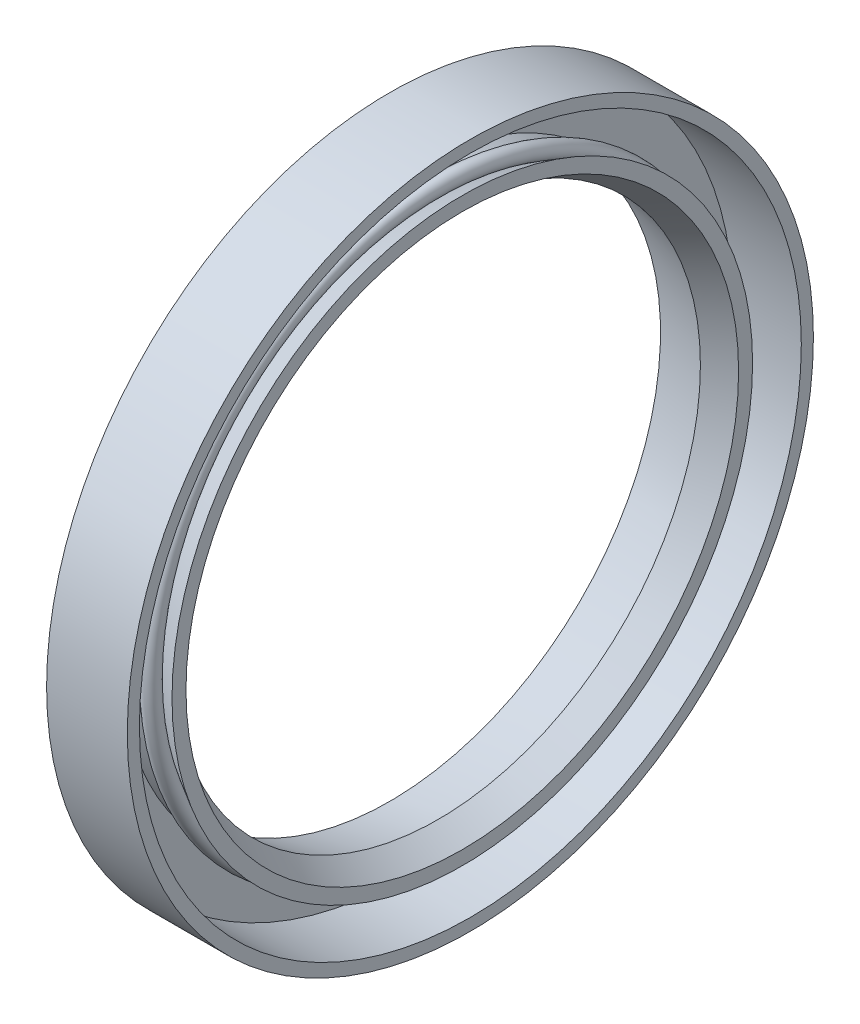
ISO-10303-21;
HEADER;
FILE_DESCRIPTION(('STEP AP214'),'2;1');
FILE_NAME('part.step','',(''),(''),'','','');
FILE_SCHEMA(('AUTOMOTIVE_DESIGN { 1 0 10303 214 1 1 1 1 }'));
ENDSEC;
DATA;
#1=APPLICATION_CONTEXT('core data for automotive mechanical design processes');
#2=APPLICATION_PROTOCOL_DEFINITION('international standard','automotive_design',2000,#1);
#3=PRODUCT_CONTEXT('',#1,'mechanical');
#4=PRODUCT('Part','Part','',(#3));
#5=PRODUCT_RELATED_PRODUCT_CATEGORY('part','',(#4));
#6=PRODUCT_DEFINITION_FORMATION('','',#4);
#7=PRODUCT_DEFINITION_CONTEXT('part definition',#1,'design');
#8=PRODUCT_DEFINITION('design','',#6,#7);
#9=PRODUCT_DEFINITION_SHAPE('','',#8);
#10=(LENGTH_UNIT() NAMED_UNIT(*) SI_UNIT(.MILLI.,.METRE.));
#11=(NAMED_UNIT(*) PLANE_ANGLE_UNIT() SI_UNIT($,.RADIAN.));
#12=(NAMED_UNIT(*) SI_UNIT($,.STERADIAN.) SOLID_ANGLE_UNIT());
#13=UNCERTAINTY_MEASURE_WITH_UNIT(LENGTH_MEASURE(1.E-05),#10,'distance_accuracy_value','');
#14=(GEOMETRIC_REPRESENTATION_CONTEXT(3) GLOBAL_UNCERTAINTY_ASSIGNED_CONTEXT((#13)) GLOBAL_UNIT_ASSIGNED_CONTEXT((#10,
#11,#12)) REPRESENTATION_CONTEXT('',''));
#15=CARTESIAN_POINT('',(0.,0.,0.));
#16=DIRECTION('',(0.,0.,1.));
#17=DIRECTION('',(1.,0.,0.));
#18=AXIS2_PLACEMENT_3D('',#15,#16,#17);
#19=CARTESIAN_POINT('',(5.53801867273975,0.,0.));
#20=DIRECTION('',(-1.,0.,0.));
#21=DIRECTION('',(0.,0.,1.));
#22=AXIS2_PLACEMENT_3D('',#19,#20,#21);
#23=TOROIDAL_SURFACE('',#22,35.1200263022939,1.);
#24=CARTESIAN_POINT('',(5.53801867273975,0.,36.1200263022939));
#25=VERTEX_POINT('',#24);
#26=VERTEX_LOOP('',#25);
#27=FACE_BOUND('',#26,.T.);
#28=ADVANCED_FACE('F436',(#27),#23,.T.);
#29=CLOSED_SHELL('',(#28));
#30=MANIFOLD_SOLID_BREP('B2',#29);
#31=CARTESIAN_POINT('',(0.,0.,0.));
#32=DIRECTION('',(-1.,0.,0.));
#33=DIRECTION('',(0.,0.,1.));
#34=AXIS2_PLACEMENT_3D('',#31,#32,#33);
#35=CONICAL_SURFACE('',#34,33.5579618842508,0.17453292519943);
#36=CARTESIAN_POINT('',(6.,0.,0.));
#37=DIRECTION('',(-1.,0.,0.));
#38=DIRECTION('',(0.,0.,1.));
#39=AXIS2_PLACEMENT_3D('',#36,#37,#38);
#40=CIRCLE('',#39,32.5);
#41=CARTESIAN_POINT('',(6.,0.,32.5));
#42=VERTEX_POINT('',#41);
#43=EDGE_CURVE('E435',#42,#42,#40,.T.);
#44=ORIENTED_EDGE('',*,*,#43,.F.);
#45=EDGE_LOOP('',(#44));
#46=FACE_BOUND('',#45,.T.);
#47=CARTESIAN_POINT('',(0.,0.,0.));
#48=DIRECTION('',(-1.,0.,0.));
#49=DIRECTION('',(0.,0.,1.));
#50=AXIS2_PLACEMENT_3D('',#47,#48,#49);
#51=CIRCLE('',#50,33.5579618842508);
#52=CARTESIAN_POINT('',(0.,0.,33.5579618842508));
#53=VERTEX_POINT('',#52);
#54=EDGE_CURVE('E483',#53,#53,#51,.T.);
#55=ORIENTED_EDGE('',*,*,#54,.T.);
#56=EDGE_LOOP('',(#55));
#57=FACE_BOUND('',#56,.T.);
#58=ADVANCED_FACE('F446',(#46,#57),#35,.F.);
#59=CARTESIAN_POINT('',(6.,0.,0.));
#60=DIRECTION('',(1.,0.,0.));
#61=DIRECTION('',(0.,0.,-1.));
#62=AXIS2_PLACEMENT_3D('',#59,#60,#61);
#63=CONICAL_SURFACE('',#62,32.5,0.523598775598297);
#64=CARTESIAN_POINT('',(9.,0.,0.));
#65=DIRECTION('',(-1.,0.,0.));
#66=DIRECTION('',(0.,0.,1.));
#67=AXIS2_PLACEMENT_3D('',#64,#65,#66);
#68=CIRCLE('',#67,34.2320508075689);
#69=CARTESIAN_POINT('',(9.,0.,34.2320508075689));
#70=VERTEX_POINT('',#69);
#71=EDGE_CURVE('E452',#70,#70,#68,.T.);
#72=ORIENTED_EDGE('',*,*,#71,.F.);
#73=EDGE_LOOP('',(#72));
#74=FACE_BOUND('',#73,.T.);
#75=ORIENTED_EDGE('',*,*,#43,.T.);
#76=EDGE_LOOP('',(#75));
#77=FACE_BOUND('',#76,.T.);
#78=ADVANCED_FACE('F538',(#74,#77),#63,.F.);
#79=CARTESIAN_POINT('',(9.,35.9641016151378,0.));
#80=DIRECTION('',(-1.,0.,0.));
#81=DIRECTION('',(0.,0.,1.));
#82=AXIS2_PLACEMENT_3D('',#79,#80,#81);
#83=PLANE('',#82);
#84=CARTESIAN_POINT('',(9.,0.,0.));
#85=DIRECTION('',(-1.,0.,0.));
#86=DIRECTION('',(0.,0.,1.));
#87=AXIS2_PLACEMENT_3D('',#84,#85,#86);
#88=CIRCLE('',#87,35.9641016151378);
#89=CARTESIAN_POINT('',(9.,0.,35.9641016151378));
#90=VERTEX_POINT('',#89);
#91=EDGE_CURVE('E456',#90,#90,#88,.T.);
#92=ORIENTED_EDGE('',*,*,#91,.F.);
#93=EDGE_LOOP('',(#92));
#94=FACE_BOUND('',#93,.T.);
#95=ORIENTED_EDGE('',*,*,#71,.T.);
#96=EDGE_LOOP('',(#95));
#97=FACE_BOUND('',#96,.T.);
#98=ADVANCED_FACE('F533',(#94,#97),#83,.F.);
#99=CARTESIAN_POINT('',(9.,0.,0.));
#100=DIRECTION('',(1.,0.,0.));
#101=DIRECTION('',(0.,0.,-1.));
#102=AXIS2_PLACEMENT_3D('',#99,#100,#101);
#103=CONICAL_SURFACE('',#102,35.9641016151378,0.523598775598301);
#104=CARTESIAN_POINT('',(6.03801867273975,0.,0.));
#105=DIRECTION('',(-1.,0.,0.));
#106=DIRECTION('',(0.,0.,1.));
#107=AXIS2_PLACEMENT_3D('',#104,#105,#106);
#108=CIRCLE('',#107,34.2540008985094);
#109=CARTESIAN_POINT('',(6.03801867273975,0.,34.2540008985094));
#110=VERTEX_POINT('',#109);
#111=EDGE_CURVE('E460',#110,#110,#108,.T.);
#112=ORIENTED_EDGE('',*,*,#111,.F.);
#113=EDGE_LOOP('',(#112));
#114=FACE_BOUND('',#113,.T.);
#115=ORIENTED_EDGE('',*,*,#91,.T.);
#116=EDGE_LOOP('',(#115));
#117=FACE_BOUND('',#116,.T.);
#118=ADVANCED_FACE('F527',(#114,#117),#103,.T.);
#119=CARTESIAN_POINT('',(5.53801867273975,0.,0.));
#120=DIRECTION('',(-1.,0.,0.));
#121=DIRECTION('',(0.,0.,1.));
#122=AXIS2_PLACEMENT_3D('',#119,#120,#121);
#123=TOROIDAL_SURFACE('',#122,35.1200263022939,1.00000000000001);
#124=CARTESIAN_POINT('',(5.36437049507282,0.,0.));
#125=DIRECTION('',(-1.,0.,0.));
#126=DIRECTION('',(0.,0.,1.));
#127=AXIS2_PLACEMENT_3D('',#124,#125,#126);
#128=CIRCLE('',#127,34.1352185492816);
#129=CARTESIAN_POINT('',(5.36437049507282,0.,34.1352185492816));
#130=VERTEX_POINT('',#129);
#131=EDGE_CURVE('E465',#130,#130,#128,.T.);
#132=ORIENTED_EDGE('',*,*,#131,.F.);
#133=EDGE_LOOP('',(#132));
#134=FACE_BOUND('',#133,.T.);
#135=ORIENTED_EDGE('',*,*,#111,.T.);
#136=EDGE_LOOP('',(#135));
#137=FACE_BOUND('',#136,.T.);
#138=ADVANCED_FACE('F521',(#134,#137),#123,.F.);
#139=CARTESIAN_POINT('',(5.36437049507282,0.,0.));
#140=DIRECTION('',(-1.,0.,0.));
#141=DIRECTION('',(0.,0.,1.));
#142=AXIS2_PLACEMENT_3D('',#139,#140,#141);
#143=CONICAL_SURFACE('',#142,34.1352185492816,0.174532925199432);
#144=CARTESIAN_POINT('',(1.5,0.,0.));
#145=DIRECTION('',(-1.,0.,0.));
#146=DIRECTION('',(0.,0.,1.));
#147=AXIS2_PLACEMENT_3D('',#144,#145,#146);
#148=CIRCLE('',#147,34.8166113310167);
#149=CARTESIAN_POINT('',(1.5,0.,34.8166113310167));
#150=VERTEX_POINT('',#149);
#151=EDGE_CURVE('E468',#150,#150,#148,.T.);
#152=ORIENTED_EDGE('',*,*,#151,.F.);
#153=EDGE_LOOP('',(#152));
#154=FACE_BOUND('',#153,.T.);
#155=ORIENTED_EDGE('',*,*,#131,.T.);
#156=EDGE_LOOP('',(#155));
#157=FACE_BOUND('',#156,.T.);
#158=ADVANCED_FACE('F515',(#154,#157),#143,.T.);
#159=CARTESIAN_POINT('',(1.5,41.,0.));
#160=DIRECTION('',(-1.,0.,0.));
#161=DIRECTION('',(0.,0.,1.));
#162=AXIS2_PLACEMENT_3D('',#159,#160,#161);
#163=PLANE('',#162);
#164=CARTESIAN_POINT('',(1.5,0.,0.));
#165=DIRECTION('',(-1.,0.,0.));
#166=DIRECTION('',(0.,0.,1.));
#167=AXIS2_PLACEMENT_3D('',#164,#165,#166);
#168=CIRCLE('',#167,41.);
#169=CARTESIAN_POINT('',(1.5,0.,41.));
#170=VERTEX_POINT('',#169);
#171=EDGE_CURVE('E471',#170,#170,#168,.T.);
#172=ORIENTED_EDGE('',*,*,#171,.F.);
#173=EDGE_LOOP('',(#172));
#174=FACE_BOUND('',#173,.T.);
#175=ORIENTED_EDGE('',*,*,#151,.T.);
#176=EDGE_LOOP('',(#175));
#177=FACE_BOUND('',#176,.T.);
#178=ADVANCED_FACE('F509',(#174,#177),#163,.F.);
#179=CARTESIAN_POINT('',(-26.6044395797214,0.,0.));
#180=DIRECTION('',(-1.,0.,0.));
#181=DIRECTION('',(0.,0.,1.));
#182=AXIS2_PLACEMENT_3D('',#179,#180,#181);
#183=CYLINDRICAL_SURFACE('',#182,41.);
#184=CARTESIAN_POINT('',(10.,0.,0.));
#185=DIRECTION('',(-1.,0.,0.));
#186=DIRECTION('',(0.,0.,1.));
#187=AXIS2_PLACEMENT_3D('',#184,#185,#186);
#188=CIRCLE('',#187,41.);
#189=CARTESIAN_POINT('',(10.,0.,41.));
#190=VERTEX_POINT('',#189);
#191=EDGE_CURVE('E474',#190,#190,#188,.T.);
#192=ORIENTED_EDGE('',*,*,#191,.F.);
#193=EDGE_LOOP('',(#192));
#194=FACE_BOUND('',#193,.T.);
#195=ORIENTED_EDGE('',*,*,#171,.T.);
#196=EDGE_LOOP('',(#195));
#197=FACE_BOUND('',#196,.T.);
#198=ADVANCED_FACE('F503',(#194,#197),#183,.F.);
#199=CARTESIAN_POINT('',(10.,42.5,0.));
#200=DIRECTION('',(-1.,0.,0.));
#201=DIRECTION('',(0.,0.,1.));
#202=AXIS2_PLACEMENT_3D('',#199,#200,#201);
#203=PLANE('',#202);
#204=CARTESIAN_POINT('',(10.,0.,0.));
#205=DIRECTION('',(-1.,0.,0.));
#206=DIRECTION('',(0.,0.,1.));
#207=AXIS2_PLACEMENT_3D('',#204,#205,#206);
#208=CIRCLE('',#207,42.5);
#209=CARTESIAN_POINT('',(10.,0.,42.5));
#210=VERTEX_POINT('',#209);
#211=EDGE_CURVE('E477',#210,#210,#208,.T.);
#212=ORIENTED_EDGE('',*,*,#211,.F.);
#213=EDGE_LOOP('',(#212));
#214=FACE_BOUND('',#213,.T.);
#215=ORIENTED_EDGE('',*,*,#191,.T.);
#216=EDGE_LOOP('',(#215));
#217=FACE_BOUND('',#216,.T.);
#218=ADVANCED_FACE('F497',(#214,#217),#203,.F.);
#219=CARTESIAN_POINT('',(-26.6044395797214,0.,0.));
#220=DIRECTION('',(-1.,0.,0.));
#221=DIRECTION('',(0.,0.,1.));
#222=AXIS2_PLACEMENT_3D('',#219,#220,#221);
#223=CYLINDRICAL_SURFACE('',#222,42.5);
#224=CARTESIAN_POINT('',(0.,0.,0.));
#225=DIRECTION('',(-1.,0.,0.));
#226=DIRECTION('',(0.,0.,1.));
#227=AXIS2_PLACEMENT_3D('',#224,#225,#226);
#228=CIRCLE('',#227,42.5);
#229=CARTESIAN_POINT('',(0.,0.,42.5));
#230=VERTEX_POINT('',#229);
#231=EDGE_CURVE('E480',#230,#230,#228,.T.);
#232=ORIENTED_EDGE('',*,*,#231,.F.);
#233=EDGE_LOOP('',(#232));
#234=FACE_BOUND('',#233,.T.);
#235=ORIENTED_EDGE('',*,*,#211,.T.);
#236=EDGE_LOOP('',(#235));
#237=FACE_BOUND('',#236,.T.);
#238=ADVANCED_FACE('F491',(#234,#237),#223,.T.);
#239=CARTESIAN_POINT('',(0.,33.5579618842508,0.));
#240=DIRECTION('',(1.,0.,0.));
#241=DIRECTION('',(0.,0.,-1.));
#242=AXIS2_PLACEMENT_3D('',#239,#240,#241);
#243=PLANE('',#242);
#244=ORIENTED_EDGE('',*,*,#54,.F.);
#245=EDGE_LOOP('',(#244));
#246=FACE_BOUND('',#245,.T.);
#247=ORIENTED_EDGE('',*,*,#231,.T.);
#248=EDGE_LOOP('',(#247));
#249=FACE_BOUND('',#248,.T.);
#250=ADVANCED_FACE('F488',(#246,#249),#243,.F.);
#251=CLOSED_SHELL('',(#58,#78,#98,#118,#138,#158,#178,#198,#218,#238,#250));
#252=MANIFOLD_SOLID_BREP('B6',#251);
#253=ADVANCED_BREP_SHAPE_REPRESENTATION('',(#18,#30,#252),#14);
#254=SHAPE_DEFINITION_REPRESENTATION(#9,#253);
ENDSEC;
END-ISO-10303-21;
